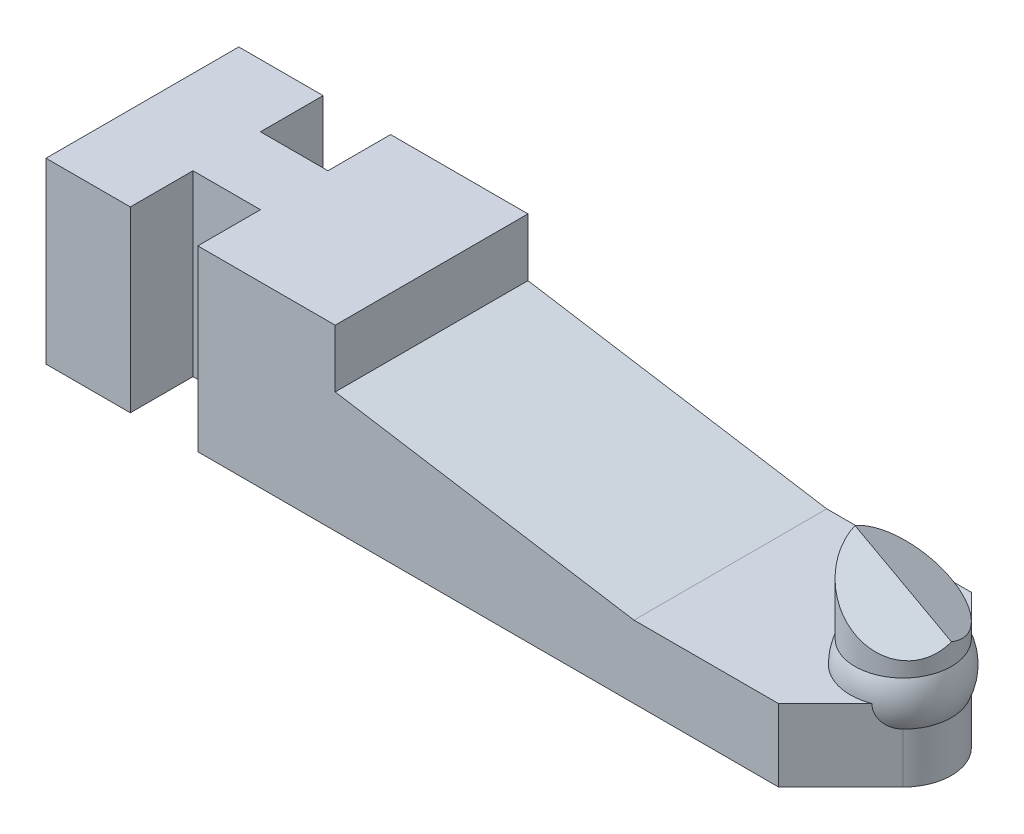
ISO-10303-21;
HEADER;
FILE_DESCRIPTION(('STEP AP214'),'2;1');
FILE_NAME('part.step','',(''),(''),'','','');
FILE_SCHEMA(('AUTOMOTIVE_DESIGN { 1 0 10303 214 1 1 1 1 }'));
ENDSEC;
DATA;
#1=APPLICATION_CONTEXT('core data for automotive mechanical design processes');
#2=APPLICATION_PROTOCOL_DEFINITION('international standard','automotive_design',2000,#1);
#3=PRODUCT_CONTEXT('',#1,'mechanical');
#4=PRODUCT('Part','Part','',(#3));
#5=PRODUCT_RELATED_PRODUCT_CATEGORY('part','',(#4));
#6=PRODUCT_DEFINITION_FORMATION('','',#4);
#7=PRODUCT_DEFINITION_CONTEXT('part definition',#1,'design');
#8=PRODUCT_DEFINITION('design','',#6,#7);
#9=PRODUCT_DEFINITION_SHAPE('','',#8);
#10=(LENGTH_UNIT() NAMED_UNIT(*) SI_UNIT(.MILLI.,.METRE.));
#11=(NAMED_UNIT(*) PLANE_ANGLE_UNIT() SI_UNIT($,.RADIAN.));
#12=(NAMED_UNIT(*) SI_UNIT($,.STERADIAN.) SOLID_ANGLE_UNIT());
#13=UNCERTAINTY_MEASURE_WITH_UNIT(LENGTH_MEASURE(1.E-05),#10,'distance_accuracy_value','');
#14=(GEOMETRIC_REPRESENTATION_CONTEXT(3) GLOBAL_UNCERTAINTY_ASSIGNED_CONTEXT((#13)) GLOBAL_UNIT_ASSIGNED_CONTEXT((#10,
#11,#12)) REPRESENTATION_CONTEXT('',''));
#15=CARTESIAN_POINT('',(0.,0.,0.));
#16=DIRECTION('',(0.,0.,1.));
#17=DIRECTION('',(1.,0.,0.));
#18=AXIS2_PLACEMENT_3D('',#15,#16,#17);
#19=CARTESIAN_POINT('',(17.2,1.5,4.));
#20=DIRECTION('',(0.,-1.,0.));
#21=DIRECTION('',(1.,0.,0.));
#22=AXIS2_PLACEMENT_3D('',#19,#20,#21);
#23=PLANE('',#22);
#24=CARTESIAN_POINT('',(15.7867056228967,1.5,2.));
#25=DIRECTION('',(0.,-1.,0.));
#26=DIRECTION('',(1.,0.,0.));
#27=AXIS2_PLACEMENT_3D('',#24,#25,#26);
#28=CIRCLE('',#27,1.1);
#29=CARTESIAN_POINT('',(16.1683147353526,1.5,0.968314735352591));
#30=VERTEX_POINT('',#29);
#31=CARTESIAN_POINT('',(16.1683147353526,1.5,3.03168526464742));
#32=VERTEX_POINT('',#31);
#33=EDGE_CURVE('E188',#30,#32,#28,.F.);
#34=ORIENTED_EDGE('',*,*,#33,.F.);
#35=DIRECTION('',(0.707106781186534,0.,0.707106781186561));
#36=VECTOR('',#35,1.);
#37=CARTESIAN_POINT('',(15.2000000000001,1.5,0.));
#38=LINE('',#37,#36);
#39=CARTESIAN_POINT('',(15.2,1.5,0.));
#40=VERTEX_POINT('',#39);
#41=EDGE_CURVE('E177',#40,#30,#38,.T.);
#42=ORIENTED_EDGE('',*,*,#41,.F.);
#43=DIRECTION('',(-1.,0.,0.));
#44=VECTOR('',#43,1.);
#45=CARTESIAN_POINT('',(17.2,1.5,0.));
#46=LINE('',#45,#44);
#47=CARTESIAN_POINT('',(12.2,1.5,0.));
#48=VERTEX_POINT('',#47);
#49=EDGE_CURVE('E193',#40,#48,#46,.T.);
#50=ORIENTED_EDGE('',*,*,#49,.T.);
#51=DIRECTION('',(0.,0.,-1.));
#52=VECTOR('',#51,1.);
#53=CARTESIAN_POINT('',(12.2,1.5,4.));
#54=LINE('',#53,#52);
#55=CARTESIAN_POINT('',(12.2,1.5,4.));
#56=VERTEX_POINT('',#55);
#57=EDGE_CURVE('E313',#56,#48,#54,.T.);
#58=ORIENTED_EDGE('',*,*,#57,.F.);
#59=DIRECTION('',(-1.,0.,0.));
#60=VECTOR('',#59,1.);
#61=CARTESIAN_POINT('',(17.2,1.5,4.));
#62=LINE('',#61,#60);
#63=CARTESIAN_POINT('',(15.2,1.5,4.));
#64=VERTEX_POINT('',#63);
#65=EDGE_CURVE('E248',#64,#56,#62,.T.);
#66=ORIENTED_EDGE('',*,*,#65,.F.);
#67=DIRECTION('',(-0.707106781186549,0.,0.707106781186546));
#68=VECTOR('',#67,1.);
#69=CARTESIAN_POINT('',(16.4928932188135,1.5,2.70710678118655));
#70=LINE('',#69,#68);
#71=EDGE_CURVE('E190',#32,#64,#70,.T.);
#72=ORIENTED_EDGE('',*,*,#71,.F.);
#73=EDGE_LOOP('',(#34,#42,#50,#58,#66,#72));
#74=FACE_BOUND('',#73,.T.);
#75=ADVANCED_FACE('F42',(#74),#23,.F.);
#76=CARTESIAN_POINT('',(16.4928932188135,0.,2.70710678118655));
#77=DIRECTION('',(-0.707106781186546,0.,-0.707106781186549));
#78=DIRECTION('',(-0.707106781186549,0.,0.707106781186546));
#79=AXIS2_PLACEMENT_3D('',#76,#77,#78);
#80=PLANE('',#79);
#81=CARTESIAN_POINT('',(16.4933528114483,1.5,2.70664718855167));
#82=DIRECTION('',(-0.707106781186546,0.,-0.707106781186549));
#83=DIRECTION('',(-0.707106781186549,0.,0.707106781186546));
#84=AXIS2_PLACEMENT_3D('',#81,#82,#83);
#85=CIRCLE('',#84,0.459673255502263);
#86=CARTESIAN_POINT('',(16.4928932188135,1.04032720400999,2.70710678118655));
#87=VERTEX_POINT('',#86);
#88=EDGE_CURVE('E60',#32,#87,#85,.F.);
#89=ORIENTED_EDGE('',*,*,#88,.F.);
#90=ORIENTED_EDGE('',*,*,#71,.T.);
#91=DIRECTION('',(0.,1.,0.));
#92=VECTOR('',#91,1.);
#93=CARTESIAN_POINT('',(15.2,0.,4.));
#94=LINE('',#93,#92);
#95=CARTESIAN_POINT('',(15.2,0.,4.));
#96=VERTEX_POINT('',#95);
#97=EDGE_CURVE('E245',#96,#64,#94,.T.);
#98=ORIENTED_EDGE('',*,*,#97,.F.);
#99=DIRECTION('',(-0.707106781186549,0.,0.707106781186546));
#100=VECTOR('',#99,1.);
#101=CARTESIAN_POINT('',(16.4928932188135,0.,2.70710678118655));
#102=LINE('',#101,#100);
#103=CARTESIAN_POINT('',(16.4928932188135,0.,2.70710678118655));
#104=VERTEX_POINT('',#103);
#105=EDGE_CURVE('E219',#104,#96,#102,.T.);
#106=ORIENTED_EDGE('',*,*,#105,.F.);
#107=DIRECTION('',(0.,1.,0.));
#108=VECTOR('',#107,1.);
#109=CARTESIAN_POINT('',(16.4928932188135,0.,2.70710678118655));
#110=LINE('',#109,#108);
#111=EDGE_CURVE('E216',#104,#87,#110,.T.);
#112=ORIENTED_EDGE('',*,*,#111,.T.);
#113=EDGE_LOOP('',(#89,#90,#98,#106,#112));
#114=FACE_BOUND('',#113,.T.);
#115=ADVANCED_FACE('F348',(#114),#80,.F.);
#116=CARTESIAN_POINT('',(15.7857864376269,0.,2.));
#117=DIRECTION('',(0.,1.,0.));
#118=DIRECTION('',(-1.,0.,0.));
#119=AXIS2_PLACEMENT_3D('',#116,#117,#118);
#120=CYLINDRICAL_SURFACE('',#119,1.);
#121=CARTESIAN_POINT('',(15.0788985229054,1.04316345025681,1.29267442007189));
#122=CARTESIAN_POINT('',(15.0391695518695,1.04324338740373,1.33238232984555));
#123=CARTESIAN_POINT('',(15.0027649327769,1.04331665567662,1.37547427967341));
#124=CARTESIAN_POINT('',(14.9376777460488,1.0434476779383,1.46719504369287));
#125=CARTESIAN_POINT('',(14.9090045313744,1.04350541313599,1.515830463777));
#126=CARTESIAN_POINT('',(14.860243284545,1.04360360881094,1.61720680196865));
#127=CARTESIAN_POINT('',(14.8401511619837,1.04364407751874,1.66994574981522));
#128=CARTESIAN_POINT('',(14.8091122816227,1.04370659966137,1.77803391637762));
#129=CARTESIAN_POINT('',(14.7981632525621,1.04372865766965,1.83338248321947));
#130=CARTESIAN_POINT('',(14.7857107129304,1.04375374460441,1.94513829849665));
#131=CARTESIAN_POINT('',(14.7842081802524,1.04375677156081,2.00154565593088));
#132=CARTESIAN_POINT('',(14.7906944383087,1.04374370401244,2.11381415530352));
#133=CARTESIAN_POINT('',(14.7986836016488,1.04372760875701,2.16967527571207));
#134=CARTESIAN_POINT('',(14.8239267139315,1.04367675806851,2.27926229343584));
#135=CARTESIAN_POINT('',(14.8411804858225,1.04364200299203,2.33298823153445));
#136=CARTESIAN_POINT('',(14.8844628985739,1.04355483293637,2.43678076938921));
#137=CARTESIAN_POINT('',(14.9104915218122,1.04350241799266,2.48684737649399));
#138=CARTESIAN_POINT('',(14.9705848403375,1.04338143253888,2.58190027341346));
#139=CARTESIAN_POINT('',(15.0046495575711,1.04331286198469,2.6268865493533));
#140=CARTESIAN_POINT('',(15.0798479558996,1.04316153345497,2.71050152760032));
#141=CARTESIAN_POINT('',(15.1209816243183,1.04307877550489,2.74913024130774));
#142=CARTESIAN_POINT('',(15.2091503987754,1.04290144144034,2.81893372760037));
#143=CARTESIAN_POINT('',(15.2561855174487,1.04280686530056,2.85010848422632));
#144=CARTESIAN_POINT('',(15.3548219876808,1.04260860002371,2.90411902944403));
#145=CARTESIAN_POINT('',(15.4064233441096,1.04250491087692,2.92695480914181));
#146=CARTESIAN_POINT('',(15.5127275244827,1.04229137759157,2.96363915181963));
#147=CARTESIAN_POINT('',(15.5674303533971,1.04218153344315,2.97748770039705));
#148=CARTESIAN_POINT('',(15.6783845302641,1.04195881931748,2.99580440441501));
#149=CARTESIAN_POINT('',(15.7346358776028,1.04184594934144,3.0002725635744));
#150=CARTESIAN_POINT('',(15.8470903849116,1.04162038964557,2.99970166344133));
#151=CARTESIAN_POINT('',(15.9032935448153,1.04150769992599,2.99466259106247));
#152=CARTESIAN_POINT('',(16.0140561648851,1.04128569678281,2.9752202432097));
#153=CARTESIAN_POINT('',(16.068615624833,1.04117638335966,2.96081696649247));
#154=CARTESIAN_POINT('',(16.1745420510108,1.0409642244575,2.92305507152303));
#155=CARTESIAN_POINT('',(16.2259090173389,1.04086137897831,2.89969645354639));
#156=CARTESIAN_POINT('',(16.323992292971,1.04066506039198,2.84468695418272));
#157=CARTESIAN_POINT('',(16.3707086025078,1.04057158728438,2.8130360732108));
#158=CARTESIAN_POINT('',(16.4581643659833,1.04039664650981,2.74234056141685));
#159=CARTESIAN_POINT('',(16.4989038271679,1.04031517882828,2.7032959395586));
#160=CARTESIAN_POINT('',(16.5732494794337,1.0401665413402,2.61892127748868));
#161=CARTESIAN_POINT('',(16.606855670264,1.04009937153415,2.57359123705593));
#162=CARTESIAN_POINT('',(16.6659807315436,1.03998121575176,2.47793261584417));
#163=CARTESIAN_POINT('',(16.6914996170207,1.03993022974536,2.42760404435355));
#164=CARTESIAN_POINT('',(16.7337257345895,1.03984587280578,2.32337697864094));
#165=CARTESIAN_POINT('',(16.7504329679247,1.03981250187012,2.26947848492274));
#166=CARTESIAN_POINT('',(16.7745614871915,1.03976430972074,2.1596416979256));
#167=CARTESIAN_POINT('',(16.7819827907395,1.03974948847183,2.10370340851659));
#168=CARTESIAN_POINT('',(16.7873288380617,1.03973881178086,1.99137483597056));
#169=CARTESIAN_POINT('',(16.7852535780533,1.03974295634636,1.93498455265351));
#170=CARTESIAN_POINT('',(16.7716654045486,1.03977009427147,1.82335280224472));
#171=CARTESIAN_POINT('',(16.7601524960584,1.03979308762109,1.76811133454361));
#172=CARTESIAN_POINT('',(16.7280158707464,1.03985727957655,1.66034538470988));
#173=CARTESIAN_POINT('',(16.7073921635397,1.03989847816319,1.60782089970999));
#174=CARTESIAN_POINT('',(16.6576193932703,1.03999792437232,1.50697985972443));
#175=CARTESIAN_POINT('',(16.6284703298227,1.04005617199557,1.4586633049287));
#176=CARTESIAN_POINT('',(16.5624742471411,1.0401880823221,1.36760960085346));
#177=CARTESIAN_POINT('',(16.5256272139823,1.04026174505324,1.32487246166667));
#178=CARTESIAN_POINT('',(16.445281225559,1.04042241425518,1.24619087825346));
#179=CARTESIAN_POINT('',(16.4017822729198,1.04050942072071,1.2102464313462));
#180=CARTESIAN_POINT('',(16.3093671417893,1.04069432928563,1.14617049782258));
#181=CARTESIAN_POINT('',(16.2604509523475,1.04079223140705,1.11803902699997));
#182=CARTESIAN_POINT('',(16.158588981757,1.04099617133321,1.07038718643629));
#183=CARTESIAN_POINT('',(16.1056431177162,1.04110220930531,1.05086699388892));
#184=CARTESIAN_POINT('',(15.9972277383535,1.04131941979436,1.02099337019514));
#185=CARTESIAN_POINT('',(15.9417583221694,1.04143059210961,1.01063957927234));
#186=CARTESIAN_POINT('',(15.8298746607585,1.0416549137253,0.999391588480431));
#187=CARTESIAN_POINT('',(15.7734605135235,1.04176806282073,0.998496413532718));
#188=CARTESIAN_POINT('',(15.6612673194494,1.04199317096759,1.0061907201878));
#189=CARTESIAN_POINT('',(15.6054884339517,1.04210512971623,1.01478255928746));
#190=CARTESIAN_POINT('',(15.4961433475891,1.04232468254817,1.04121245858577));
#191=CARTESIAN_POINT('',(15.4425782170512,1.04243227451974,1.05905493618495));
#192=CARTESIAN_POINT('',(15.3392523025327,1.04263988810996,1.10347206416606));
#193=CARTESIAN_POINT('',(15.2894870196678,1.0427399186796,1.13003618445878));
#194=CARTESIAN_POINT('',(15.212867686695,1.04289397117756,1.17963464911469));
#195=CARTESIAN_POINT('',(15.184421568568,1.04295117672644,1.20025548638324));
#196=CARTESIAN_POINT('',(15.1298504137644,1.043060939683,1.24436852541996));
#197=CARTESIAN_POINT('',(15.1037253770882,1.04311349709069,1.26786072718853));
#198=CARTESIAN_POINT('',(15.0788985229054,1.04316345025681,1.29267442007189));
#199=B_SPLINE_CURVE_WITH_KNOTS('',3,(#121,#122,#123,#124,#125,#126,#127,#128,#129,#130,#131,
#132,#133,#134,#135,#136,#137,#138,#139,#140,#141,#142,#143,#144,#145,#146,#147,#148,#149,#150,
#151,#152,#153,#154,#155,#156,#157,#158,#159,#160,#161,#162,#163,#164,#165,#166,#167,#168,#169,
#170,#171,#172,#173,#174,#175,#176,#177,#178,#179,#180,#181,#182,#183,#184,#185,#186,#187,#188,
#189,#190,#191,#192,#193,#194,#195,#196,#197,#198),.UNSPECIFIED.,.T.,.F.,(4,2,2,2,2,2,2,2,2,2,2,
2,2,2,2,2,2,2,2,2,2,2,2,2,2,2,2,2,2,2,2,2,2,2,2,2,2,2,4),(0.,0.168383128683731,
0.336969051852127,0.505474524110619,0.673938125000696,0.842419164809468,1.01090681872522,
1.17939125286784,1.34787534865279,1.51635990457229,1.68484415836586,1.85332877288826,
2.02181356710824,2.19029863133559,2.35878362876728,2.52726885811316,2.69575410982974,
2.86423935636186,3.03272459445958,3.20120962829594,3.36969466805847,3.5381793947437,
3.70666409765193,3.87514848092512,4.04363293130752,4.21211729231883,4.38060147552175,
4.54908566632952,4.71757016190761,4.88605459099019,5.05453936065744,5.22302759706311,
5.39150922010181,5.55997347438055,5.72847960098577,5.89706626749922,6.06545013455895,
6.17067368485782,6.27589723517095),.UNSPECIFIED.);
#200=CARTESIAN_POINT('',(16.4928932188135,1.04032720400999,1.29289321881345));
#201=VERTEX_POINT('',#200);
#202=EDGE_CURVE('E68',#87,#201,#199,.T.);
#203=ORIENTED_EDGE('',*,*,#202,.F.);
#204=ORIENTED_EDGE('',*,*,#111,.F.);
#205=CARTESIAN_POINT('',(15.7857864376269,0.,2.));
#206=DIRECTION('',(0.,-1.,0.));
#207=DIRECTION('',(1.,0.,0.));
#208=AXIS2_PLACEMENT_3D('',#205,#206,#207);
#209=CIRCLE('',#208,1.);
#210=CARTESIAN_POINT('',(16.4928932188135,0.,1.29289321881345));
#211=VERTEX_POINT('',#210);
#212=EDGE_CURVE('E223',#211,#104,#209,.T.);
#213=ORIENTED_EDGE('',*,*,#212,.F.);
#214=DIRECTION('',(0.,1.,0.));
#215=VECTOR('',#214,1.);
#216=CARTESIAN_POINT('',(16.4928932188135,0.,1.29289321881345));
#217=LINE('',#216,#215);
#218=EDGE_CURVE('E185',#211,#201,#217,.T.);
#219=ORIENTED_EDGE('',*,*,#218,.T.);
#220=EDGE_LOOP('',(#203,#204,#213,#219));
#221=FACE_BOUND('',#220,.T.);
#222=ADVANCED_FACE('F44',(#221),#120,.T.);
#223=CARTESIAN_POINT('',(15.2000000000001,0.,0.));
#224=DIRECTION('',(-0.707106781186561,0.,0.707106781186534));
#225=DIRECTION('',(0.707106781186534,0.,0.707106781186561));
#226=AXIS2_PLACEMENT_3D('',#223,#224,#225);
#227=PLANE('',#226);
#228=CARTESIAN_POINT('',(16.4933528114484,1.5,1.29335281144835));
#229=DIRECTION('',(-0.707106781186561,0.,0.707106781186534));
#230=DIRECTION('',(0.707106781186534,0.,0.707106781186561));
#231=AXIS2_PLACEMENT_3D('',#228,#229,#230);
#232=CIRCLE('',#231,0.459673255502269);
#233=EDGE_CURVE('E47',#201,#30,#232,.F.);
#234=ORIENTED_EDGE('',*,*,#233,.F.);
#235=ORIENTED_EDGE('',*,*,#218,.F.);
#236=DIRECTION('',(0.707106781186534,0.,0.707106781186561));
#237=VECTOR('',#236,1.);
#238=CARTESIAN_POINT('',(15.2000000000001,0.,0.));
#239=LINE('',#238,#237);
#240=CARTESIAN_POINT('',(15.2000000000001,0.,0.));
#241=VERTEX_POINT('',#240);
#242=EDGE_CURVE('E224',#241,#211,#239,.T.);
#243=ORIENTED_EDGE('',*,*,#242,.F.);
#244=DIRECTION('',(0.,1.,0.));
#245=VECTOR('',#244,1.);
#246=CARTESIAN_POINT('',(15.2000000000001,0.,0.));
#247=LINE('',#246,#245);
#248=EDGE_CURVE('E182',#241,#40,#247,.T.);
#249=ORIENTED_EDGE('',*,*,#248,.T.);
#250=ORIENTED_EDGE('',*,*,#41,.T.);
#251=EDGE_LOOP('',(#234,#235,#243,#249,#250));
#252=FACE_BOUND('',#251,.T.);
#253=ADVANCED_FACE('F179',(#252),#227,.F.);
#254=CARTESIAN_POINT('',(0.,0.,0.));
#255=DIRECTION('',(0.,0.,1.));
#256=DIRECTION('',(1.,0.,0.));
#257=AXIS2_PLACEMENT_3D('',#254,#255,#256);
#258=PLANE('',#257);
#259=ORIENTED_EDGE('',*,*,#49,.F.);
#260=ORIENTED_EDGE('',*,*,#248,.F.);
#261=DIRECTION('',(1.,0.,0.));
#262=VECTOR('',#261,1.);
#263=CARTESIAN_POINT('',(0.,0.,0.));
#264=LINE('',#263,#262);
#265=CARTESIAN_POINT('',(3.15,0.,0.));
#266=VERTEX_POINT('',#265);
#267=EDGE_CURVE('E228',#266,#241,#264,.T.);
#268=ORIENTED_EDGE('',*,*,#267,.F.);
#269=DIRECTION('',(0.,1.,0.));
#270=VECTOR('',#269,1.);
#271=CARTESIAN_POINT('',(3.15,0.,0.));
#272=LINE('',#271,#270);
#273=CARTESIAN_POINT('',(3.15,3.7,0.));
#274=VERTEX_POINT('',#273);
#275=EDGE_CURVE('E249',#266,#274,#272,.T.);
#276=ORIENTED_EDGE('',*,*,#275,.T.);
#277=DIRECTION('',(-1.,0.,0.));
#278=VECTOR('',#277,1.);
#279=CARTESIAN_POINT('',(6.,3.7,0.));
#280=LINE('',#279,#278);
#281=CARTESIAN_POINT('',(6.,3.7,0.));
#282=VERTEX_POINT('',#281);
#283=EDGE_CURVE('E317',#282,#274,#280,.T.);
#284=ORIENTED_EDGE('',*,*,#283,.F.);
#285=DIRECTION('',(0.,1.,0.));
#286=VECTOR('',#285,1.);
#287=CARTESIAN_POINT('',(6.,2.5,0.));
#288=LINE('',#287,#286);
#289=CARTESIAN_POINT('',(6.,2.5,0.));
#290=VERTEX_POINT('',#289);
#291=EDGE_CURVE('E314',#290,#282,#288,.T.);
#292=ORIENTED_EDGE('',*,*,#291,.F.);
#293=DIRECTION('',(-0.987241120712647,0.159232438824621,0.));
#294=VECTOR('',#293,1.);
#295=CARTESIAN_POINT('',(12.2,1.5,0.));
#296=LINE('',#295,#294);
#297=EDGE_CURVE('E227',#48,#290,#296,.T.);
#298=ORIENTED_EDGE('',*,*,#297,.F.);
#299=EDGE_LOOP('',(#259,#260,#268,#276,#284,#292,#298));
#300=FACE_BOUND('',#299,.T.);
#301=ADVANCED_FACE('F371',(#300),#258,.F.);
#302=CARTESIAN_POINT('',(0.,0.,4.));
#303=DIRECTION('',(0.,0.,1.));
#304=DIRECTION('',(1.,0.,0.));
#305=AXIS2_PLACEMENT_3D('',#302,#303,#304);
#306=PLANE('',#305);
#307=ORIENTED_EDGE('',*,*,#97,.T.);
#308=ORIENTED_EDGE('',*,*,#65,.T.);
#309=DIRECTION('',(-0.987241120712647,0.159232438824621,0.));
#310=VECTOR('',#309,1.);
#311=CARTESIAN_POINT('',(12.2,1.5,4.));
#312=LINE('',#311,#310);
#313=CARTESIAN_POINT('',(6.,2.5,4.));
#314=VERTEX_POINT('',#313);
#315=EDGE_CURVE('E327',#56,#314,#312,.T.);
#316=ORIENTED_EDGE('',*,*,#315,.T.);
#317=DIRECTION('',(0.,1.,0.));
#318=VECTOR('',#317,1.);
#319=CARTESIAN_POINT('',(6.,2.5,4.));
#320=LINE('',#319,#318);
#321=CARTESIAN_POINT('',(6.,3.7,4.));
#322=VERTEX_POINT('',#321);
#323=EDGE_CURVE('E329',#314,#322,#320,.T.);
#324=ORIENTED_EDGE('',*,*,#323,.T.);
#325=DIRECTION('',(-1.,0.,0.));
#326=VECTOR('',#325,1.);
#327=CARTESIAN_POINT('',(6.,3.7,4.));
#328=LINE('',#327,#326);
#329=CARTESIAN_POINT('',(3.15,3.7,4.));
#330=VERTEX_POINT('',#329);
#331=EDGE_CURVE('E331',#322,#330,#328,.T.);
#332=ORIENTED_EDGE('',*,*,#331,.T.);
#333=DIRECTION('',(0.,1.,0.));
#334=VECTOR('',#333,1.);
#335=CARTESIAN_POINT('',(3.15,0.,4.));
#336=LINE('',#335,#334);
#337=CARTESIAN_POINT('',(3.15,0.,4.));
#338=VERTEX_POINT('',#337);
#339=EDGE_CURVE('E279',#338,#330,#336,.T.);
#340=ORIENTED_EDGE('',*,*,#339,.F.);
#341=DIRECTION('',(1.,0.,0.));
#342=VECTOR('',#341,1.);
#343=CARTESIAN_POINT('',(0.,0.,4.));
#344=LINE('',#343,#342);
#345=EDGE_CURVE('E306',#338,#96,#344,.T.);
#346=ORIENTED_EDGE('',*,*,#345,.T.);
#347=EDGE_LOOP('',(#307,#308,#316,#324,#332,#340,#346));
#348=FACE_BOUND('',#347,.T.);
#349=ADVANCED_FACE('F406',(#348),#306,.T.);
#350=CARTESIAN_POINT('',(0.,3.7,4.));
#351=DIRECTION('',(1.,0.,0.));
#352=DIRECTION('',(0.,1.,0.));
#353=AXIS2_PLACEMENT_3D('',#350,#351,#352);
#354=PLANE('',#353);
#355=DIRECTION('',(0.,-1.,0.));
#356=VECTOR('',#355,1.);
#357=CARTESIAN_POINT('',(0.,3.7,0.));
#358=LINE('',#357,#356);
#359=CARTESIAN_POINT('',(0.,3.7,0.));
#360=VERTEX_POINT('',#359);
#361=CARTESIAN_POINT('',(0.,0.,0.));
#362=VERTEX_POINT('',#361);
#363=EDGE_CURVE('E304',#360,#362,#358,.T.);
#364=ORIENTED_EDGE('',*,*,#363,.T.);
#365=DIRECTION('',(0.,0.,-1.));
#366=VECTOR('',#365,1.);
#367=CARTESIAN_POINT('',(0.,0.,4.));
#368=LINE('',#367,#366);
#369=CARTESIAN_POINT('',(0.,0.,4.));
#370=VERTEX_POINT('',#369);
#371=EDGE_CURVE('E295',#370,#362,#368,.T.);
#372=ORIENTED_EDGE('',*,*,#371,.F.);
#373=DIRECTION('',(0.,-1.,0.));
#374=VECTOR('',#373,1.);
#375=CARTESIAN_POINT('',(0.,3.7,4.));
#376=LINE('',#375,#374);
#377=CARTESIAN_POINT('',(0.,3.7,4.));
#378=VERTEX_POINT('',#377);
#379=EDGE_CURVE('E321',#378,#370,#376,.T.);
#380=ORIENTED_EDGE('',*,*,#379,.F.);
#381=DIRECTION('',(0.,0.,-1.));
#382=VECTOR('',#381,1.);
#383=CARTESIAN_POINT('',(0.,3.7,4.));
#384=LINE('',#383,#382);
#385=EDGE_CURVE('E232',#378,#360,#384,.T.);
#386=ORIENTED_EDGE('',*,*,#385,.T.);
#387=EDGE_LOOP('',(#364,#372,#380,#386));
#388=FACE_BOUND('',#387,.T.);
#389=ADVANCED_FACE('F423',(#388),#354,.F.);
#390=CARTESIAN_POINT('',(0.,0.,4.));
#391=DIRECTION('',(0.,1.,0.));
#392=DIRECTION('',(0.,0.,1.));
#393=AXIS2_PLACEMENT_3D('',#390,#391,#392);
#394=PLANE('',#393);
#395=ORIENTED_EDGE('',*,*,#212,.T.);
#396=ORIENTED_EDGE('',*,*,#105,.T.);
#397=ORIENTED_EDGE('',*,*,#345,.F.);
#398=DIRECTION('',(0.,0.,-1.));
#399=VECTOR('',#398,1.);
#400=CARTESIAN_POINT('',(3.15,0.,4.));
#401=LINE('',#400,#399);
#402=CARTESIAN_POINT('',(3.15,0.,2.7));
#403=VERTEX_POINT('',#402);
#404=EDGE_CURVE('E222',#338,#403,#401,.T.);
#405=ORIENTED_EDGE('',*,*,#404,.T.);
#406=DIRECTION('',(-1.,0.,0.));
#407=VECTOR('',#406,1.);
#408=CARTESIAN_POINT('',(3.15,0.,2.7));
#409=LINE('',#408,#407);
#410=CARTESIAN_POINT('',(1.75,0.,2.7));
#411=VERTEX_POINT('',#410);
#412=EDGE_CURVE('E289',#403,#411,#409,.T.);
#413=ORIENTED_EDGE('',*,*,#412,.T.);
#414=DIRECTION('',(0.,0.,1.));
#415=VECTOR('',#414,1.);
#416=CARTESIAN_POINT('',(1.75,0.,4.));
#417=LINE('',#416,#415);
#418=CARTESIAN_POINT('',(1.75,0.,4.));
#419=VERTEX_POINT('',#418);
#420=EDGE_CURVE('E292',#411,#419,#417,.T.);
#421=ORIENTED_EDGE('',*,*,#420,.T.);
#422=EDGE_CURVE('E280',#370,#419,#344,.T.);
#423=ORIENTED_EDGE('',*,*,#422,.F.);
#424=ORIENTED_EDGE('',*,*,#371,.T.);
#425=CARTESIAN_POINT('',(1.75,0.,0.));
#426=VERTEX_POINT('',#425);
#427=EDGE_CURVE('E268',#362,#426,#264,.T.);
#428=ORIENTED_EDGE('',*,*,#427,.T.);
#429=DIRECTION('',(0.,0.,1.));
#430=VECTOR('',#429,1.);
#431=CARTESIAN_POINT('',(1.75,0.,0.));
#432=LINE('',#431,#430);
#433=CARTESIAN_POINT('',(1.75,0.,1.29999999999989));
#434=VERTEX_POINT('',#433);
#435=EDGE_CURVE('E265',#426,#434,#432,.T.);
#436=ORIENTED_EDGE('',*,*,#435,.T.);
#437=DIRECTION('',(1.,0.,0.));
#438=VECTOR('',#437,1.);
#439=CARTESIAN_POINT('',(3.15,0.,1.29999999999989));
#440=LINE('',#439,#438);
#441=CARTESIAN_POINT('',(3.15,0.,1.29999999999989));
#442=VERTEX_POINT('',#441);
#443=EDGE_CURVE('E264',#434,#442,#440,.T.);
#444=ORIENTED_EDGE('',*,*,#443,.T.);
#445=DIRECTION('',(0.,0.,-1.));
#446=VECTOR('',#445,1.);
#447=CARTESIAN_POINT('',(3.15,0.,0.));
#448=LINE('',#447,#446);
#449=EDGE_CURVE('E261',#442,#266,#448,.T.);
#450=ORIENTED_EDGE('',*,*,#449,.T.);
#451=ORIENTED_EDGE('',*,*,#267,.T.);
#452=ORIENTED_EDGE('',*,*,#242,.T.);
#453=EDGE_LOOP('',(#395,#396,#397,#405,#413,#421,#423,#424,#428,#436,#444,#450,#451,#452));
#454=FACE_BOUND('',#453,.T.);
#455=ADVANCED_FACE('F417',(#454),#394,.F.);
#456=CARTESIAN_POINT('',(12.2,1.5,4.));
#457=DIRECTION('',(-0.159232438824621,-0.987241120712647,0.));
#458=DIRECTION('',(0.987241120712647,-0.159232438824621,0.));
#459=AXIS2_PLACEMENT_3D('',#456,#457,#458);
#460=PLANE('',#459);
#461=ORIENTED_EDGE('',*,*,#297,.T.);
#462=DIRECTION('',(0.,0.,-1.));
#463=VECTOR('',#462,1.);
#464=CARTESIAN_POINT('',(6.,2.5,4.));
#465=LINE('',#464,#463);
#466=EDGE_CURVE('E316',#314,#290,#465,.T.);
#467=ORIENTED_EDGE('',*,*,#466,.F.);
#468=ORIENTED_EDGE('',*,*,#315,.F.);
#469=ORIENTED_EDGE('',*,*,#57,.T.);
#470=EDGE_LOOP('',(#461,#467,#468,#469));
#471=FACE_BOUND('',#470,.T.);
#472=ADVANCED_FACE('F413',(#471),#460,.F.);
#473=CARTESIAN_POINT('',(6.,2.5,4.));
#474=DIRECTION('',(-1.,0.,0.));
#475=DIRECTION('',(0.,0.,1.));
#476=AXIS2_PLACEMENT_3D('',#473,#474,#475);
#477=PLANE('',#476);
#478=ORIENTED_EDGE('',*,*,#291,.T.);
#479=DIRECTION('',(0.,0.,-1.));
#480=VECTOR('',#479,1.);
#481=CARTESIAN_POINT('',(6.,3.7,4.));
#482=LINE('',#481,#480);
#483=EDGE_CURVE('E301',#322,#282,#482,.T.);
#484=ORIENTED_EDGE('',*,*,#483,.F.);
#485=ORIENTED_EDGE('',*,*,#323,.F.);
#486=ORIENTED_EDGE('',*,*,#466,.T.);
#487=EDGE_LOOP('',(#478,#484,#485,#486));
#488=FACE_BOUND('',#487,.T.);
#489=ADVANCED_FACE('F409',(#488),#477,.F.);
#490=CARTESIAN_POINT('',(6.,3.7,4.));
#491=DIRECTION('',(0.,-1.,0.));
#492=DIRECTION('',(1.,0.,0.));
#493=AXIS2_PLACEMENT_3D('',#490,#491,#492);
#494=PLANE('',#493);
#495=ORIENTED_EDGE('',*,*,#283,.T.);
#496=DIRECTION('',(0.,0.,-1.));
#497=VECTOR('',#496,1.);
#498=CARTESIAN_POINT('',(3.15,3.7,0.));
#499=LINE('',#498,#497);
#500=CARTESIAN_POINT('',(3.15,3.7,1.29999999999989));
#501=VERTEX_POINT('',#500);
#502=EDGE_CURVE('E250',#501,#274,#499,.T.);
#503=ORIENTED_EDGE('',*,*,#502,.F.);
#504=DIRECTION('',(1.,0.,0.));
#505=VECTOR('',#504,1.);
#506=CARTESIAN_POINT('',(3.15,3.7,1.29999999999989));
#507=LINE('',#506,#505);
#508=CARTESIAN_POINT('',(1.75,3.7,1.29999999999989));
#509=VERTEX_POINT('',#508);
#510=EDGE_CURVE('E258',#509,#501,#507,.T.);
#511=ORIENTED_EDGE('',*,*,#510,.F.);
#512=DIRECTION('',(0.,0.,1.));
#513=VECTOR('',#512,1.);
#514=CARTESIAN_POINT('',(1.75,3.7,0.));
#515=LINE('',#514,#513);
#516=CARTESIAN_POINT('',(1.75,3.7,0.));
#517=VERTEX_POINT('',#516);
#518=EDGE_CURVE('E254',#517,#509,#515,.T.);
#519=ORIENTED_EDGE('',*,*,#518,.F.);
#520=EDGE_CURVE('E320',#517,#360,#280,.T.);
#521=ORIENTED_EDGE('',*,*,#520,.T.);
#522=ORIENTED_EDGE('',*,*,#385,.F.);
#523=CARTESIAN_POINT('',(1.75,3.7,4.));
#524=VERTEX_POINT('',#523);
#525=EDGE_CURVE('E300',#524,#378,#328,.T.);
#526=ORIENTED_EDGE('',*,*,#525,.F.);
#527=DIRECTION('',(0.,0.,1.));
#528=VECTOR('',#527,1.);
#529=CARTESIAN_POINT('',(1.75,3.7,4.));
#530=LINE('',#529,#528);
#531=CARTESIAN_POINT('',(1.75,3.7,2.7));
#532=VERTEX_POINT('',#531);
#533=EDGE_CURVE('E285',#532,#524,#530,.T.);
#534=ORIENTED_EDGE('',*,*,#533,.F.);
#535=DIRECTION('',(-1.,0.,0.));
#536=VECTOR('',#535,1.);
#537=CARTESIAN_POINT('',(3.15,3.7,2.7));
#538=LINE('',#537,#536);
#539=CARTESIAN_POINT('',(3.15,3.7,2.7));
#540=VERTEX_POINT('',#539);
#541=EDGE_CURVE('E281',#540,#532,#538,.T.);
#542=ORIENTED_EDGE('',*,*,#541,.F.);
#543=DIRECTION('',(0.,0.,-1.));
#544=VECTOR('',#543,1.);
#545=CARTESIAN_POINT('',(3.15,3.7,4.));
#546=LINE('',#545,#544);
#547=EDGE_CURVE('E276',#330,#540,#546,.T.);
#548=ORIENTED_EDGE('',*,*,#547,.F.);
#549=ORIENTED_EDGE('',*,*,#331,.F.);
#550=ORIENTED_EDGE('',*,*,#483,.T.);
#551=EDGE_LOOP('',(#495,#503,#511,#519,#521,#522,#526,#534,#542,#548,#549,#550));
#552=FACE_BOUND('',#551,.T.);
#553=ADVANCED_FACE('F404',(#552),#494,.F.);
#554=DIRECTION('',(0.,1.,0.));
#555=VECTOR('',#554,1.);
#556=CARTESIAN_POINT('',(1.75,0.,4.));
#557=LINE('',#556,#555);
#558=EDGE_CURVE('E297',#419,#524,#557,.T.);
#559=ORIENTED_EDGE('',*,*,#558,.T.);
#560=ORIENTED_EDGE('',*,*,#525,.T.);
#561=ORIENTED_EDGE('',*,*,#379,.T.);
#562=ORIENTED_EDGE('',*,*,#422,.T.);
#563=EDGE_LOOP('',(#559,#560,#561,#562));
#564=FACE_BOUND('',#563,.T.);
#565=ADVANCED_FACE('F400',(#564),#306,.T.);
#566=ORIENTED_EDGE('',*,*,#520,.F.);
#567=DIRECTION('',(0.,1.,0.));
#568=VECTOR('',#567,1.);
#569=CARTESIAN_POINT('',(1.75,0.,0.));
#570=LINE('',#569,#568);
#571=EDGE_CURVE('E217',#426,#517,#570,.T.);
#572=ORIENTED_EDGE('',*,*,#571,.F.);
#573=ORIENTED_EDGE('',*,*,#427,.F.);
#574=ORIENTED_EDGE('',*,*,#363,.F.);
#575=EDGE_LOOP('',(#566,#572,#573,#574));
#576=FACE_BOUND('',#575,.T.);
#577=ADVANCED_FACE('F396',(#576),#258,.F.);
#578=CARTESIAN_POINT('',(3.15,0.,4.));
#579=DIRECTION('',(1.,0.,0.));
#580=DIRECTION('',(0.,1.,0.));
#581=AXIS2_PLACEMENT_3D('',#578,#579,#580);
#582=PLANE('',#581);
#583=ORIENTED_EDGE('',*,*,#547,.T.);
#584=DIRECTION('',(0.,1.,0.));
#585=VECTOR('',#584,1.);
#586=CARTESIAN_POINT('',(3.15,0.,2.7));
#587=LINE('',#586,#585);
#588=EDGE_CURVE('E253',#403,#540,#587,.T.);
#589=ORIENTED_EDGE('',*,*,#588,.F.);
#590=ORIENTED_EDGE('',*,*,#404,.F.);
#591=ORIENTED_EDGE('',*,*,#339,.T.);
#592=EDGE_LOOP('',(#583,#589,#590,#591));
#593=FACE_BOUND('',#592,.T.);
#594=ADVANCED_FACE('F389',(#593),#582,.F.);
#595=CARTESIAN_POINT('',(1.75,0.,4.));
#596=DIRECTION('',(-1.,0.,0.));
#597=DIRECTION('',(0.,-1.,0.));
#598=AXIS2_PLACEMENT_3D('',#595,#596,#597);
#599=PLANE('',#598);
#600=ORIENTED_EDGE('',*,*,#533,.T.);
#601=ORIENTED_EDGE('',*,*,#558,.F.);
#602=ORIENTED_EDGE('',*,*,#420,.F.);
#603=DIRECTION('',(0.,1.,0.));
#604=VECTOR('',#603,1.);
#605=CARTESIAN_POINT('',(1.75,0.,2.7));
#606=LINE('',#605,#604);
#607=EDGE_CURVE('E284',#411,#532,#606,.T.);
#608=ORIENTED_EDGE('',*,*,#607,.T.);
#609=EDGE_LOOP('',(#600,#601,#602,#608));
#610=FACE_BOUND('',#609,.T.);
#611=ADVANCED_FACE('F386',(#610),#599,.F.);
#612=CARTESIAN_POINT('',(3.15,0.,2.7));
#613=DIRECTION('',(0.,0.,-1.));
#614=DIRECTION('',(-1.,0.,0.));
#615=AXIS2_PLACEMENT_3D('',#612,#613,#614);
#616=PLANE('',#615);
#617=ORIENTED_EDGE('',*,*,#541,.T.);
#618=ORIENTED_EDGE('',*,*,#607,.F.);
#619=ORIENTED_EDGE('',*,*,#412,.F.);
#620=ORIENTED_EDGE('',*,*,#588,.T.);
#621=EDGE_LOOP('',(#617,#618,#619,#620));
#622=FACE_BOUND('',#621,.T.);
#623=ADVANCED_FACE('F384',(#622),#616,.F.);
#624=CARTESIAN_POINT('',(3.15,0.,0.));
#625=DIRECTION('',(1.,0.,0.));
#626=DIRECTION('',(0.,1.,0.));
#627=AXIS2_PLACEMENT_3D('',#624,#625,#626);
#628=PLANE('',#627);
#629=ORIENTED_EDGE('',*,*,#502,.T.);
#630=ORIENTED_EDGE('',*,*,#275,.F.);
#631=ORIENTED_EDGE('',*,*,#449,.F.);
#632=DIRECTION('',(0.,1.,0.));
#633=VECTOR('',#632,1.);
#634=CARTESIAN_POINT('',(3.15,0.,1.29999999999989));
#635=LINE('',#634,#633);
#636=EDGE_CURVE('E252',#442,#501,#635,.T.);
#637=ORIENTED_EDGE('',*,*,#636,.T.);
#638=EDGE_LOOP('',(#629,#630,#631,#637));
#639=FACE_BOUND('',#638,.T.);
#640=ADVANCED_FACE('F377',(#639),#628,.F.);
#641=CARTESIAN_POINT('',(3.15,0.,1.29999999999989));
#642=DIRECTION('',(0.,0.,1.));
#643=DIRECTION('',(1.,0.,0.));
#644=AXIS2_PLACEMENT_3D('',#641,#642,#643);
#645=PLANE('',#644);
#646=ORIENTED_EDGE('',*,*,#510,.T.);
#647=ORIENTED_EDGE('',*,*,#636,.F.);
#648=ORIENTED_EDGE('',*,*,#443,.F.);
#649=DIRECTION('',(0.,1.,0.));
#650=VECTOR('',#649,1.);
#651=CARTESIAN_POINT('',(1.75,0.,1.29999999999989));
#652=LINE('',#651,#650);
#653=EDGE_CURVE('E257',#434,#509,#652,.T.);
#654=ORIENTED_EDGE('',*,*,#653,.T.);
#655=EDGE_LOOP('',(#646,#647,#648,#654));
#656=FACE_BOUND('',#655,.T.);
#657=ADVANCED_FACE('F374',(#656),#645,.F.);
#658=CARTESIAN_POINT('',(1.75,0.,0.));
#659=DIRECTION('',(-1.,0.,0.));
#660=DIRECTION('',(0.,-1.,0.));
#661=AXIS2_PLACEMENT_3D('',#658,#659,#660);
#662=PLANE('',#661);
#663=ORIENTED_EDGE('',*,*,#518,.T.);
#664=ORIENTED_EDGE('',*,*,#653,.F.);
#665=ORIENTED_EDGE('',*,*,#435,.F.);
#666=ORIENTED_EDGE('',*,*,#571,.T.);
#667=EDGE_LOOP('',(#663,#664,#665,#666));
#668=FACE_BOUND('',#667,.T.);
#669=ADVANCED_FACE('F362',(#668),#662,.F.);
#670=CARTESIAN_POINT('',(15.7867056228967,1.5,2.));
#671=DIRECTION('',(0.,1.,0.));
#672=DIRECTION('',(1.,0.,0.));
#673=AXIS2_PLACEMENT_3D('',#670,#671,#672);
#674=SPHERICAL_SURFACE('',#673,1.1);
#675=ORIENTED_EDGE('',*,*,#233,.T.);
#676=ORIENTED_EDGE('',*,*,#33,.T.);
#677=ORIENTED_EDGE('',*,*,#88,.T.);
#678=ORIENTED_EDGE('',*,*,#202,.T.);
#679=EDGE_LOOP('',(#675,#676,#677,#678));
#680=FACE_BOUND('',#679,.T.);
#681=CARTESIAN_POINT('',(15.0783774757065,1.95683550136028,1.29319552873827));
#682=CARTESIAN_POINT('',(15.1180808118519,1.95691538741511,1.25346176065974));
#683=CARTESIAN_POINT('',(15.1611685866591,1.95700206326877,1.21705197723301));
#684=CARTESIAN_POINT('',(15.2528819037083,1.95718649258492,1.1519538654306));
#685=CARTESIAN_POINT('',(15.3015140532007,1.95728425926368,1.12327488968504));
#686=CARTESIAN_POINT('',(15.4028848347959,1.95748797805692,1.0745016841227));
#687=CARTESIAN_POINT('',(15.4556214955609,1.95759392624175,1.054403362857));
#688=CARTESIAN_POINT('',(15.5637061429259,1.95781098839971,1.0233518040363));
#689=CARTESIAN_POINT('',(15.6190534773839,1.95792210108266,1.01239629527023));
#690=CARTESIAN_POINT('',(15.7308080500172,1.95814637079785,0.9999306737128));
#691=CARTESIAN_POINT('',(15.7872153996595,1.95825952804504,0.99842155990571));
#692=CARTESIAN_POINT('',(15.8994849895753,1.95848466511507,1.0048947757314));
#693=CARTESIAN_POINT('',(15.9553472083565,1.9585966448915,1.01287747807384));
#694=CARTESIAN_POINT('',(16.0649375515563,1.95881624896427,1.03810799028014));
#695=CARTESIAN_POINT('',(16.1186657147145,1.95892387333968,1.0553556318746));
#696=CARTESIAN_POINT('',(16.2224637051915,1.95913172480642,1.09862629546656));
#697=CARTESIAN_POINT('',(16.2725335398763,1.95923195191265,1.12464929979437));
#698=CARTESIAN_POINT('',(16.3675937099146,1.95942218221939,1.18473201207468));
#699=CARTESIAN_POINT('',(16.4125840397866,1.95951218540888,1.21879172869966));
#700=CARTESIAN_POINT('',(16.496207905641,1.95967943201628,1.29398093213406));
#701=CARTESIAN_POINT('',(16.534841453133,1.9597566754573,1.33511040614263));
#702=CARTESIAN_POINT('',(16.6046551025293,1.95989623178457,1.42327156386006));
#703=CARTESIAN_POINT('',(16.635835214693,1.95995854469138,1.47030323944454));
#704=CARTESIAN_POINT('',(16.6898569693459,1.96006648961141,1.56893380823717));
#705=CARTESIAN_POINT('',(16.7126986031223,1.9601121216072,1.62053270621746));
#706=CARTESIAN_POINT('',(16.7493948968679,1.96018542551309,1.72683281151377));
#707=CARTESIAN_POINT('',(16.7632495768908,1.96021309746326,1.78153401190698));
#708=CARTESIAN_POINT('',(16.7815787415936,1.96024970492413,1.89248599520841));
#709=CARTESIAN_POINT('',(16.7860532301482,1.96025864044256,1.94873677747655));
#710=CARTESIAN_POINT('',(16.7854950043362,1.96025752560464,2.06119108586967));
#711=CARTESIAN_POINT('',(16.7804623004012,1.96024747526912,2.11739461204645));
#712=CARTESIAN_POINT('',(16.7610325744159,1.96020866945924,2.22815902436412));
#713=CARTESIAN_POINT('',(16.7466355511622,1.96017991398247,2.28271991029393));
#714=CARTESIAN_POINT('',(16.7088858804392,1.96010450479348,2.38865020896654));
#715=CARTESIAN_POINT('',(16.6855332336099,1.96005785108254,2.4400196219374));
#716=CARTESIAN_POINT('',(16.6305352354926,1.95994795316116,2.5381087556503));
#717=CARTESIAN_POINT('',(16.5988898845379,1.9598847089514,2.5848284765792));
#718=CARTESIAN_POINT('',(16.5282047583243,1.9597434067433,2.67229205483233));
#719=CARTESIAN_POINT('',(16.4891649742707,1.95966534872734,2.71303590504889));
#720=CARTESIAN_POINT('',(16.4047992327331,1.95949661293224,2.78739108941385));
#721=CARTESIAN_POINT('',(16.3594732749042,1.95940593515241,2.82100242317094));
#722=CARTESIAN_POINT('',(16.2638217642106,1.95921451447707,2.88013851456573));
#723=CARTESIAN_POINT('',(16.213496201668,1.95911377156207,2.90566325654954));
#724=CARTESIAN_POINT('',(16.1092741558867,1.95890506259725,2.94790150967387));
#725=CARTESIAN_POINT('',(16.0553776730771,1.9587970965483,2.96461502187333));
#726=CARTESIAN_POINT('',(15.9455436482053,1.95857699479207,2.98875640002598));
#727=CARTESIAN_POINT('',(15.8896061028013,1.95846485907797,2.99618425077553));
#728=CARTESIAN_POINT('',(15.7772779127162,1.95823959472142,3.00154340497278));
#729=CARTESIAN_POINT('',(15.7208872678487,1.95812646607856,2.99947470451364));
#730=CARTESIAN_POINT('',(15.6092535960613,1.95790242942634,2.98589946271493));
#731=CARTESIAN_POINT('',(15.554010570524,1.95779152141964,2.9743929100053));
#732=CARTESIAN_POINT('',(15.446240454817,1.95757508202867,2.94226859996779));
#733=CARTESIAN_POINT('',(15.3937133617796,1.95746955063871,2.92165085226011));
#734=CARTESIAN_POINT('',(15.2928661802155,1.95726687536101,2.87188944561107));
#735=CARTESIAN_POINT('',(15.2445460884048,1.95716973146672,2.84274579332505));
#736=CARTESIAN_POINT('',(15.1534844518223,1.95698660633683,2.77675980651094));
#737=CARTESIAN_POINT('',(15.110742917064,1.95690062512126,2.73991745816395));
#738=CARTESIAN_POINT('',(15.0320519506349,1.95674228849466,2.65958009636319));
#739=CARTESIAN_POINT('',(14.9961024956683,1.9566699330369,2.61608510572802));
#740=CARTESIAN_POINT('',(14.9320159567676,1.95654092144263,2.52367695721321));
#741=CARTESIAN_POINT('',(14.9038788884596,1.95648426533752,2.4747637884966));
#742=CARTESIAN_POINT('',(14.8562155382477,1.95638827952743,2.37290703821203));
#743=CARTESIAN_POINT('',(14.8366893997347,1.95634895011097,2.31996338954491));
#744=CARTESIAN_POINT('',(14.8068035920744,1.95628874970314,2.21155139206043));
#745=CARTESIAN_POINT('',(14.7964435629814,1.95626787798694,2.15608314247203));
#746=CARTESIAN_POINT('',(14.7851830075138,1.95624519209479,2.04420091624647));
#747=CARTESIAN_POINT('',(14.7842814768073,1.95624337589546,1.98778704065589));
#748=CARTESIAN_POINT('',(14.7919630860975,1.95625885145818,1.8755933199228));
#749=CARTESIAN_POINT('',(14.8005485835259,1.95627614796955,1.81981363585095));
#750=CARTESIAN_POINT('',(14.8269659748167,1.95632936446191,1.71046595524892));
#751=CARTESIAN_POINT('',(14.8448022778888,1.95636529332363,1.65689902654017));
#752=CARTESIAN_POINT('',(14.8892074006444,1.95645472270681,1.55356851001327));
#753=CARTESIAN_POINT('',(14.9157656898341,1.95650820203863,1.50380042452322));
#754=CARTESIAN_POINT('',(14.9653549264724,1.9566080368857,1.42717602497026));
#755=CARTESIAN_POINT('',(14.9859721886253,1.95664953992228,1.39872791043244));
#756=CARTESIAN_POINT('',(15.0300782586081,1.95673831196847,1.34415237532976));
#757=CARTESIAN_POINT('',(15.0535670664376,1.95678558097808,1.31802495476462));
#758=CARTESIAN_POINT('',(15.0783774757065,1.95683550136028,1.29319552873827));
#759=B_SPLINE_CURVE_WITH_KNOTS('',3,(#681,#682,#683,#684,#685,#686,#687,#688,#689,#690,#691,
#692,#693,#694,#695,#696,#697,#698,#699,#700,#701,#702,#703,#704,#705,#706,#707,#708,#709,#710,
#711,#712,#713,#714,#715,#716,#717,#718,#719,#720,#721,#722,#723,#724,#725,#726,#727,#728,#729,
#730,#731,#732,#733,#734,#735,#736,#737,#738,#739,#740,#741,#742,#743,#744,#745,#746,#747,#748,
#749,#750,#751,#752,#753,#754,#755,#756,#757,#758),.UNSPECIFIED.,.T.,.F.,(4,2,2,2,2,2,2,2,2,2,2,
2,2,2,2,2,2,2,2,2,2,2,2,2,2,2,2,2,2,2,2,2,2,2,2,2,2,2,4),(0.,0.168383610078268,
0.336970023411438,0.505475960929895,0.673940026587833,0.842421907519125,1.0109104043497,
1.17939584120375,1.34788093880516,1.51636621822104,1.68485119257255,1.85333593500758,
2.02182085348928,2.1903053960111,2.35878986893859,2.52727415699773,2.69575846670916,
2.86424276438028,3.03272705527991,3.20121154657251,3.3696960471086,3.53818087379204,
3.70666568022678,3.87515076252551,4.04363591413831,4.21212126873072,4.38060644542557,
4.54909149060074,4.71757683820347,4.88606160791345,5.05454671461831,5.22303462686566,
5.39151592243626,5.55997932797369,5.72848460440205,5.89707026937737,6.06545313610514,
6.17067518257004,6.27589722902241),.UNSPECIFIED.);
#760=CARTESIAN_POINT('',(15.0783774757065,1.95683550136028,1.29319552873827));
#761=VERTEX_POINT('',#760);
#762=EDGE_CURVE('E12',#761,#761,#759,.T.);
#763=ORIENTED_EDGE('',*,*,#762,.T.);
#764=EDGE_LOOP('',(#763));
#765=FACE_BOUND('',#764,.T.);
#766=ADVANCED_FACE('F195',(#680,#765),#674,.T.);
#767=CARTESIAN_POINT('',(14.7830131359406,3.49489770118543,2.00211368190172));
#768=DIRECTION('',(-0.448754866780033,-0.825615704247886,0.342020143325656));
#769=DIRECTION('',(0.878601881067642,-0.477554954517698,0.));
#770=AXIS2_PLACEMENT_3D('',#767,#768,#769);
#771=PLANE('',#770);
#772=DIRECTION('',(0.878601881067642,-0.477554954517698,0.));
#773=VECTOR('',#772,1.);
#774=CARTESIAN_POINT('',(15.1658528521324,3.28593352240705,2.));
#775=LINE('',#774,#773);
#776=CARTESIAN_POINT('',(14.7857864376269,3.49251468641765,2.));
#777=VERTEX_POINT('',#776);
#778=CARTESIAN_POINT('',(16.7857864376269,2.40543539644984,2.));
#779=VERTEX_POINT('',#778);
#780=EDGE_CURVE('E198',#777,#779,#775,.T.);
#781=ORIENTED_EDGE('',*,*,#780,.T.);
#782=CARTESIAN_POINT('',(15.7857864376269,2.94897504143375,2.));
#783=DIRECTION('',(-0.448754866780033,-0.825615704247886,0.342020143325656));
#784=DIRECTION('',(-0.656642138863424,0.56423284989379,0.500462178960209));
#785=AXIS2_PLACEMENT_3D('',#782,#783,#784);
#786=ELLIPSE('',#785,1.21121727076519,1.);
#787=EDGE_CURVE('E243',#777,#779,#786,.T.);
#788=ORIENTED_EDGE('',*,*,#787,.F.);
#789=EDGE_LOOP('',(#781,#788));
#790=FACE_BOUND('',#789,.T.);
#791=ADVANCED_FACE('F361',(#790),#771,.F.);
#792=CARTESIAN_POINT('',(14.7830131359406,2.58158799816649,4.20256007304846));
#793=DIRECTION('',(0.44875486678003,0.825615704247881,0.342020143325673));
#794=DIRECTION('',(-0.878601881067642,0.477554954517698,0.));
#795=AXIS2_PLACEMENT_3D('',#792,#793,#794);
#796=PLANE('',#795);
#797=ORIENTED_EDGE('',*,*,#780,.F.);
#798=CARTESIAN_POINT('',(15.7857864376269,2.94897504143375,2.));
#799=DIRECTION('',(0.44875486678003,0.825615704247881,0.342020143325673));
#800=DIRECTION('',(-0.656642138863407,0.564232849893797,-0.500462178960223));
#801=AXIS2_PLACEMENT_3D('',#798,#799,#800);
#802=ELLIPSE('',#801,1.2112172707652,1.);
#803=EDGE_CURVE('E202',#777,#779,#802,.T.);
#804=ORIENTED_EDGE('',*,*,#803,.T.);
#805=EDGE_LOOP('',(#797,#804));
#806=FACE_BOUND('',#805,.T.);
#807=ADVANCED_FACE('F363',(#806),#796,.T.);
#808=ORIENTED_EDGE('',*,*,#803,.F.);
#809=ORIENTED_EDGE('',*,*,#787,.T.);
#810=EDGE_LOOP('',(#808,#809));
#811=FACE_BOUND('',#810,.T.);
#812=ORIENTED_EDGE('',*,*,#762,.F.);
#813=EDGE_LOOP('',(#812));
#814=FACE_BOUND('',#813,.T.);
#815=ADVANCED_FACE('F367',(#811,#814),#120,.T.);
#816=CLOSED_SHELL('',(#75,#115,#222,#253,#301,#349,#389,#455,#472,#489,#553,#565,#577,#594,#611,
#623,#640,#657,#669,#766,#791,#807,#815));
#817=MANIFOLD_SOLID_BREP('B2',#816);
#818=ADVANCED_BREP_SHAPE_REPRESENTATION('',(#18,#817),#14);
#819=SHAPE_DEFINITION_REPRESENTATION(#9,#818);
ENDSEC;
END-ISO-10303-21;
